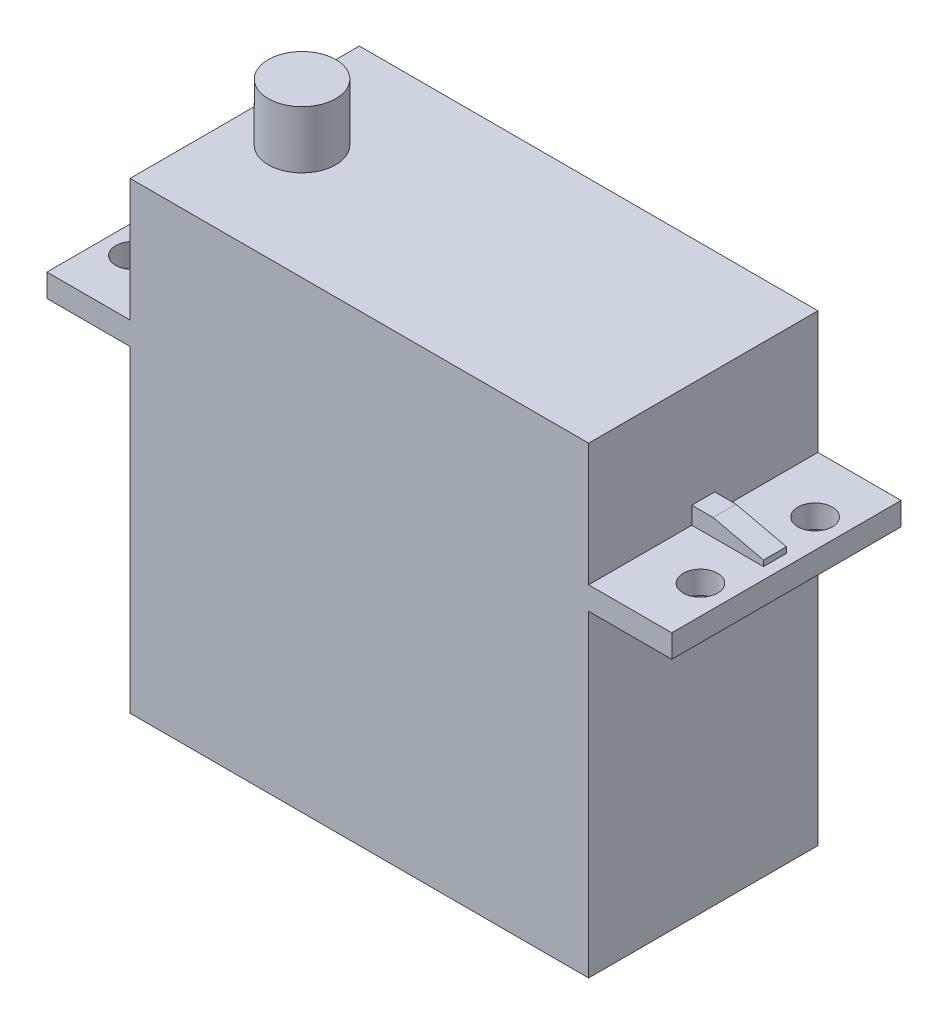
from build123d import *

# Parameters (mm, degrees)
CROQUIS1_W                   = 40
CROQUIS1_H                   = 20
SALIENTE_EXTRUIR1_DEPTH      = 40.4
CROQUIS2_W                   = 7.25
CROQUIS2_H                   = 2
SALIENTE_EXTRUIR2_DEPTH      = 20
SALIENTE_EXTRUIR3_DEPTH      = 1
SALIENTE_EXTRUIR3_DEPTH_BACK = 1
CROQUIS4_R                   = 1.5
CORTAR_EXTRUIR7_DEPTH        = 2
CROQUIS5_R                   = 2.95
SALIENTE_EXTRUIR4_DEPTH      = 5


with BuildPart() as part:
    # Croquis1 → Saliente-Extruir1 (new body)
    with BuildSketch(Plane(origin=(0, 0, 0), x_dir=(1, 0, 0), z_dir=(0, 1, 0))):
        Rectangle(CROQUIS1_W, CROQUIS1_H)
    extrude(amount=SALIENTE_EXTRUIR1_DEPTH)

    # Croquis2 → Saliente-Extruir2 (add)
    with BuildSketch(Plane.XY.offset(10)):
        with Locations((-23.625, 28.7)):
            Rectangle(CROQUIS2_W, CROQUIS2_H)
        with Locations((23.625, 28.7)):
            Rectangle(CROQUIS2_W, CROQUIS2_H)
    extrude(amount=-SALIENTE_EXTRUIR2_DEPTH)

    # Croquis3 → Saliente-Extruir3 (add, two sides: drawn at the far end of the back side and taken through both)
    with BuildSketch(Plane.XY.offset(-SALIENTE_EXTRUIR3_DEPTH_BACK)):
        Polygon((-26.25, 29.7), (-26.25, 30.2), (-21.860187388, 31.213468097), (-20, 31.213468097), (-20, 29.7), align=None)
        Polygon((20, 31.213468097), (20, 29.7), (26.25, 29.7), (26.25, 30.2), (21.860187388, 31.213468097), align=None)
    extrude(amount=SALIENTE_EXTRUIR3_DEPTH + SALIENTE_EXTRUIR3_DEPTH_BACK)

    # Croquis4 → Cortar-Extruir7 (cut)
    with BuildSketch(Plane(origin=(0, 29.7, 0), x_dir=(1, 0, 0), z_dir=(0, 1, 0))):
        with Locations(Location((-24.75, 5, 0), (0, 0, 270))):
            Circle(CROQUIS4_R)
        with Locations(Location((-24.75, -5, 0), (0, 0, 270))):
            Circle(CROQUIS4_R)
        with Locations(Location((24.75, -5, 0), (0, 0, 90))):
            Circle(CROQUIS4_R)
        with Locations(Location((24.75, 5, 0), (0, 0, 90))):
            Circle(CROQUIS4_R)
    extrude(amount=-CORTAR_EXTRUIR7_DEPTH, mode=Mode.SUBTRACT)

    # Croquis5 → Saliente-Extruir4 (add)
    with BuildSketch(Plane(origin=(0, 40.4, 0), x_dir=(1, 0, 0), z_dir=(0, 1, 0))):
        with Locations(Location((-15, 0, 0), (0, 0, 90))):
            Circle(CROQUIS5_R)
    extrude(amount=SALIENTE_EXTRUIR4_DEPTH)


solid = part.part
